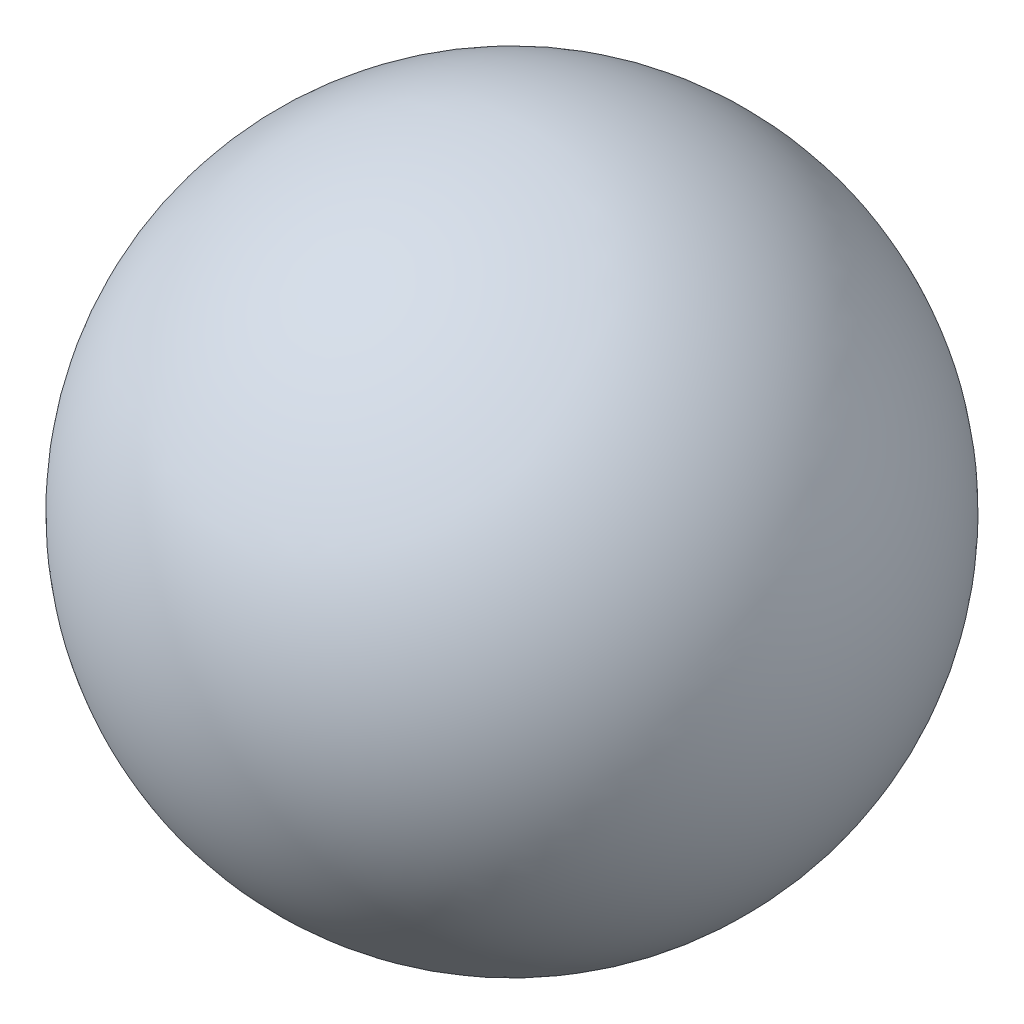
ISO-10303-21;
HEADER;
FILE_DESCRIPTION(('STEP AP214'),'2;1');
FILE_NAME('part.step','',(''),(''),'','','');
FILE_SCHEMA(('AUTOMOTIVE_DESIGN { 1 0 10303 214 1 1 1 1 }'));
ENDSEC;
DATA;
#1=APPLICATION_CONTEXT('core data for automotive mechanical design processes');
#2=APPLICATION_PROTOCOL_DEFINITION('international standard','automotive_design',2000,#1);
#3=PRODUCT_CONTEXT('',#1,'mechanical');
#4=PRODUCT('Part','Part','',(#3));
#5=PRODUCT_RELATED_PRODUCT_CATEGORY('part','',(#4));
#6=PRODUCT_DEFINITION_FORMATION('','',#4);
#7=PRODUCT_DEFINITION_CONTEXT('part definition',#1,'design');
#8=PRODUCT_DEFINITION('design','',#6,#7);
#9=PRODUCT_DEFINITION_SHAPE('','',#8);
#10=(LENGTH_UNIT() NAMED_UNIT(*) SI_UNIT(.MILLI.,.METRE.));
#11=(NAMED_UNIT(*) PLANE_ANGLE_UNIT() SI_UNIT($,.RADIAN.));
#12=(NAMED_UNIT(*) SI_UNIT($,.STERADIAN.) SOLID_ANGLE_UNIT());
#13=UNCERTAINTY_MEASURE_WITH_UNIT(LENGTH_MEASURE(1.E-05),#10,'distance_accuracy_value','');
#14=(GEOMETRIC_REPRESENTATION_CONTEXT(3) GLOBAL_UNCERTAINTY_ASSIGNED_CONTEXT((#13)) GLOBAL_UNIT_ASSIGNED_CONTEXT((#10,
#11,#12)) REPRESENTATION_CONTEXT('',''));
#15=CARTESIAN_POINT('',(0.,0.,0.));
#16=DIRECTION('',(0.,0.,1.));
#17=DIRECTION('',(1.,0.,0.));
#18=AXIS2_PLACEMENT_3D('',#15,#16,#17);
#19=CARTESIAN_POINT('',(0.,0.,0.));
#20=DIRECTION('',(0.,0.,-1.));
#21=DIRECTION('',(1.,0.,0.));
#22=AXIS2_PLACEMENT_3D('',#19,#20,#21);
#23=SPHERICAL_SURFACE('',#22,3.9624);
#24=CARTESIAN_POINT('',(0.,0.,-3.9624));
#25=VERTEX_POINT('',#24);
#26=VERTEX_LOOP('',#25);
#27=FACE_BOUND('',#26,.T.);
#28=ADVANCED_FACE('F30',(#27),#23,.T.);
#29=CLOSED_SHELL('',(#28));
#30=MANIFOLD_SOLID_BREP('B2',#29);
#31=ADVANCED_BREP_SHAPE_REPRESENTATION('',(#18,#30),#14);
#32=SHAPE_DEFINITION_REPRESENTATION(#9,#31);
ENDSEC;
END-ISO-10303-21;
